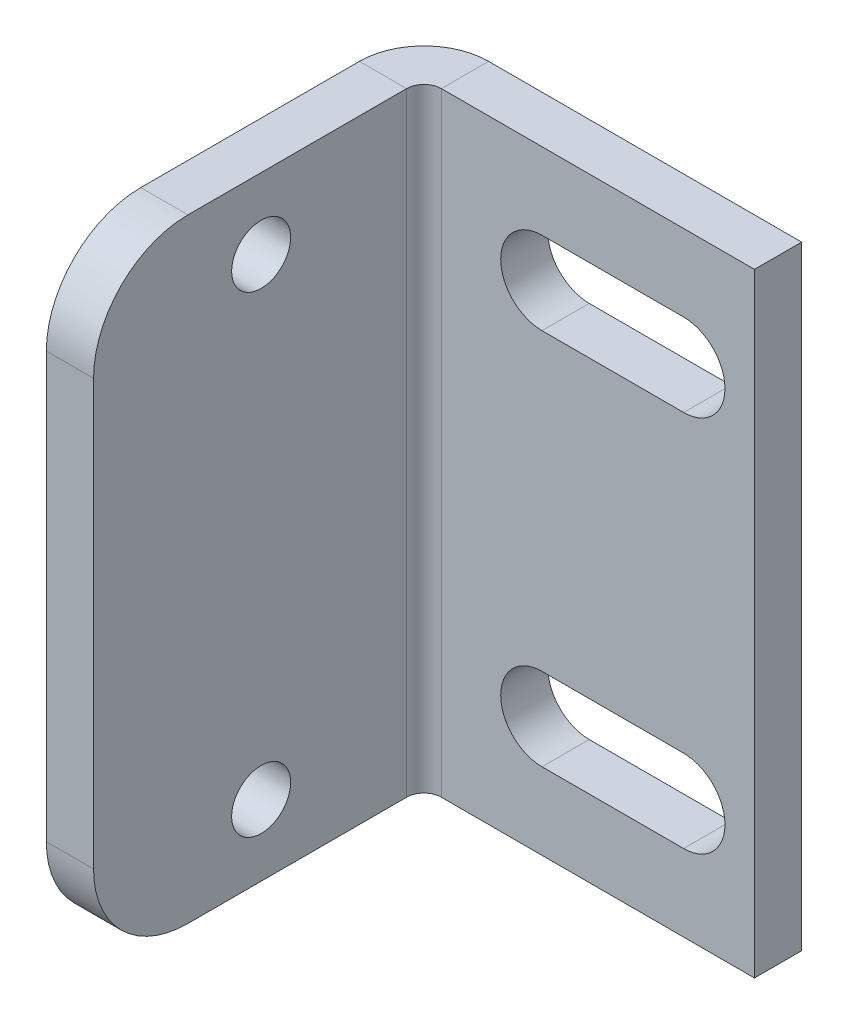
ISO-10303-21;
HEADER;
FILE_DESCRIPTION(('STEP AP214'),'2;1');
FILE_NAME('part.step','',(''),(''),'','','');
FILE_SCHEMA(('AUTOMOTIVE_DESIGN { 1 0 10303 214 1 1 1 1 }'));
ENDSEC;
DATA;
#1=APPLICATION_CONTEXT('core data for automotive mechanical design processes');
#2=APPLICATION_PROTOCOL_DEFINITION('international standard','automotive_design',2000,#1);
#3=PRODUCT_CONTEXT('',#1,'mechanical');
#4=PRODUCT('Part','Part','',(#3));
#5=PRODUCT_RELATED_PRODUCT_CATEGORY('part','',(#4));
#6=PRODUCT_DEFINITION_FORMATION('','',#4);
#7=PRODUCT_DEFINITION_CONTEXT('part definition',#1,'design');
#8=PRODUCT_DEFINITION('design','',#6,#7);
#9=PRODUCT_DEFINITION_SHAPE('','',#8);
#10=(LENGTH_UNIT() NAMED_UNIT(*) SI_UNIT(.MILLI.,.METRE.));
#11=(NAMED_UNIT(*) PLANE_ANGLE_UNIT() SI_UNIT($,.RADIAN.));
#12=(NAMED_UNIT(*) SI_UNIT($,.STERADIAN.) SOLID_ANGLE_UNIT());
#13=UNCERTAINTY_MEASURE_WITH_UNIT(LENGTH_MEASURE(1.E-05),#10,'distance_accuracy_value','');
#14=(GEOMETRIC_REPRESENTATION_CONTEXT(3) GLOBAL_UNCERTAINTY_ASSIGNED_CONTEXT((#13)) GLOBAL_UNIT_ASSIGNED_CONTEXT((#10,
#11,#12)) REPRESENTATION_CONTEXT('',''));
#15=CARTESIAN_POINT('',(0.,0.,0.));
#16=DIRECTION('',(0.,0.,1.));
#17=DIRECTION('',(1.,0.,0.));
#18=AXIS2_PLACEMENT_3D('',#15,#16,#17);
#19=CARTESIAN_POINT('',(0.,-4.47571826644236,2.));
#20=DIRECTION('',(0.,-1.,0.));
#21=DIRECTION('',(1.,0.,0.));
#22=AXIS2_PLACEMENT_3D('',#19,#20,#21);
#23=PLANE('',#22);
#24=DIRECTION('',(0.,0.,-1.));
#25=VECTOR('',#24,1.);
#26=CARTESIAN_POINT('',(-13.2634,-4.47571826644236,2.));
#27=LINE('',#26,#25);
#28=CARTESIAN_POINT('',(-13.2634,-4.47571826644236,2.));
#29=VERTEX_POINT('',#28);
#30=CARTESIAN_POINT('',(-13.2634,-4.47571826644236,0.));
#31=VERTEX_POINT('',#30);
#32=EDGE_CURVE('E262',#29,#31,#27,.T.);
#33=ORIENTED_EDGE('',*,*,#32,.F.);
#34=DIRECTION('',(-1.,0.,0.));
#35=VECTOR('',#34,1.);
#36=CARTESIAN_POINT('',(0.,-4.47571826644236,2.));
#37=LINE('',#36,#35);
#38=CARTESIAN_POINT('',(0.,-4.47571826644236,2.));
#39=VERTEX_POINT('',#38);
#40=EDGE_CURVE('E271',#39,#29,#37,.T.);
#41=ORIENTED_EDGE('',*,*,#40,.F.);
#42=DIRECTION('',(0.,0.,-1.));
#43=VECTOR('',#42,1.);
#44=CARTESIAN_POINT('',(0.,-4.47571826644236,2.));
#45=LINE('',#44,#43);
#46=CARTESIAN_POINT('',(0.,-4.47571826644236,0.));
#47=VERTEX_POINT('',#46);
#48=EDGE_CURVE('E286',#39,#47,#45,.T.);
#49=ORIENTED_EDGE('',*,*,#48,.T.);
#50=DIRECTION('',(-1.,0.,0.));
#51=VECTOR('',#50,1.);
#52=CARTESIAN_POINT('',(0.,-4.47571826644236,0.));
#53=LINE('',#52,#51);
#54=EDGE_CURVE('E280',#47,#31,#53,.T.);
#55=ORIENTED_EDGE('',*,*,#54,.T.);
#56=EDGE_LOOP('',(#33,#41,#49,#55));
#57=FACE_BOUND('',#56,.T.);
#58=ADVANCED_FACE('F16',(#57),#23,.F.);
#59=CARTESIAN_POINT('',(0.,-30.4757182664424,2.));
#60=DIRECTION('',(0.,1.,0.));
#61=DIRECTION('',(-1.,0.,0.));
#62=AXIS2_PLACEMENT_3D('',#59,#60,#61);
#63=PLANE('',#62);
#64=DIRECTION('',(0.,0.,-1.));
#65=VECTOR('',#64,1.);
#66=CARTESIAN_POINT('',(-13.2634,-30.4757182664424,2.));
#67=LINE('',#66,#65);
#68=CARTESIAN_POINT('',(-13.2634,-30.4757182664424,2.));
#69=VERTEX_POINT('',#68);
#70=CARTESIAN_POINT('',(-13.2634,-30.4757182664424,0.));
#71=VERTEX_POINT('',#70);
#72=EDGE_CURVE('E252',#69,#71,#67,.T.);
#73=ORIENTED_EDGE('',*,*,#72,.T.);
#74=DIRECTION('',(1.,0.,0.));
#75=VECTOR('',#74,1.);
#76=CARTESIAN_POINT('',(0.,-30.4757182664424,0.));
#77=LINE('',#76,#75);
#78=CARTESIAN_POINT('',(0.,-30.4757182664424,0.));
#79=VERTEX_POINT('',#78);
#80=EDGE_CURVE('E272',#71,#79,#77,.T.);
#81=ORIENTED_EDGE('',*,*,#80,.T.);
#82=DIRECTION('',(0.,0.,-1.));
#83=VECTOR('',#82,1.);
#84=CARTESIAN_POINT('',(0.,-30.4757182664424,2.));
#85=LINE('',#84,#83);
#86=CARTESIAN_POINT('',(0.,-30.4757182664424,2.));
#87=VERTEX_POINT('',#86);
#88=EDGE_CURVE('E277',#87,#79,#85,.T.);
#89=ORIENTED_EDGE('',*,*,#88,.F.);
#90=DIRECTION('',(1.,0.,0.));
#91=VECTOR('',#90,1.);
#92=CARTESIAN_POINT('',(0.,-30.4757182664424,2.));
#93=LINE('',#92,#91);
#94=EDGE_CURVE('E275',#69,#87,#93,.T.);
#95=ORIENTED_EDGE('',*,*,#94,.F.);
#96=EDGE_LOOP('',(#73,#81,#89,#95));
#97=FACE_BOUND('',#96,.T.);
#98=ADVANCED_FACE('F349',(#97),#63,.F.);
#99=CARTESIAN_POINT('',(0.,0.,2.));
#100=DIRECTION('',(0.,0.,-1.));
#101=DIRECTION('',(-1.,0.,0.));
#102=AXIS2_PLACEMENT_3D('',#99,#100,#101);
#103=PLANE('',#102);
#104=DIRECTION('',(-1.,0.,0.));
#105=VECTOR('',#104,1.);
#106=CARTESIAN_POINT('',(-3.,-7.72571826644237,2.));
#107=LINE('',#106,#105);
#108=CARTESIAN_POINT('',(-3.,-7.72571826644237,2.));
#109=VERTEX_POINT('',#108);
#110=CARTESIAN_POINT('',(-9.,-7.72571826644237,2.));
#111=VERTEX_POINT('',#110);
#112=EDGE_CURVE('E180',#109,#111,#107,.T.);
#113=ORIENTED_EDGE('',*,*,#112,.F.);
#114=CARTESIAN_POINT('',(-3.,-9.47571826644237,2.));
#115=DIRECTION('',(0.,0.,1.));
#116=DIRECTION('',(-1.,0.,0.));
#117=AXIS2_PLACEMENT_3D('',#114,#115,#116);
#118=CIRCLE('',#117,1.75);
#119=CARTESIAN_POINT('',(-3.,-11.2257182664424,2.));
#120=VERTEX_POINT('',#119);
#121=EDGE_CURVE('E150',#120,#109,#118,.T.);
#122=ORIENTED_EDGE('',*,*,#121,.F.);
#123=DIRECTION('',(1.,0.,0.));
#124=VECTOR('',#123,1.);
#125=CARTESIAN_POINT('',(-3.,-11.2257182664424,2.));
#126=LINE('',#125,#124);
#127=CARTESIAN_POINT('',(-9.,-11.2257182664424,2.));
#128=VERTEX_POINT('',#127);
#129=EDGE_CURVE('E168',#128,#120,#126,.T.);
#130=ORIENTED_EDGE('',*,*,#129,.F.);
#131=CARTESIAN_POINT('',(-9.,-9.47571826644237,2.));
#132=DIRECTION('',(0.,0.,1.));
#133=DIRECTION('',(-1.,0.,0.));
#134=AXIS2_PLACEMENT_3D('',#131,#132,#133);
#135=CIRCLE('',#134,1.75);
#136=EDGE_CURVE('E171',#111,#128,#135,.T.);
#137=ORIENTED_EDGE('',*,*,#136,.F.);
#138=EDGE_LOOP('',(#113,#122,#130,#137));
#139=FACE_BOUND('',#138,.T.);
#140=DIRECTION('',(-1.,0.,0.));
#141=VECTOR('',#140,1.);
#142=CARTESIAN_POINT('',(-3.,-23.7257182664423,2.));
#143=LINE('',#142,#141);
#144=CARTESIAN_POINT('',(-3.,-23.7257182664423,2.));
#145=VERTEX_POINT('',#144);
#146=CARTESIAN_POINT('',(-9.,-23.7257182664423,2.));
#147=VERTEX_POINT('',#146);
#148=EDGE_CURVE('E205',#145,#147,#143,.T.);
#149=ORIENTED_EDGE('',*,*,#148,.F.);
#150=CARTESIAN_POINT('',(-3.,-25.4757182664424,2.));
#151=DIRECTION('',(0.,0.,1.));
#152=DIRECTION('',(1.,0.,0.));
#153=AXIS2_PLACEMENT_3D('',#150,#151,#152);
#154=CIRCLE('',#153,1.75);
#155=CARTESIAN_POINT('',(-3.,-27.2257182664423,2.));
#156=VERTEX_POINT('',#155);
#157=EDGE_CURVE('E186',#156,#145,#154,.T.);
#158=ORIENTED_EDGE('',*,*,#157,.F.);
#159=DIRECTION('',(1.,0.,0.));
#160=VECTOR('',#159,1.);
#161=CARTESIAN_POINT('',(-3.,-27.2257182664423,2.));
#162=LINE('',#161,#160);
#163=CARTESIAN_POINT('',(-9.,-27.2257182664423,2.));
#164=VERTEX_POINT('',#163);
#165=EDGE_CURVE('E194',#164,#156,#162,.T.);
#166=ORIENTED_EDGE('',*,*,#165,.F.);
#167=CARTESIAN_POINT('',(-9.,-25.4757182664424,2.));
#168=DIRECTION('',(0.,0.,1.));
#169=DIRECTION('',(1.,0.,0.));
#170=AXIS2_PLACEMENT_3D('',#167,#168,#169);
#171=CIRCLE('',#170,1.75);
#172=EDGE_CURVE('E208',#147,#164,#171,.T.);
#173=ORIENTED_EDGE('',*,*,#172,.F.);
#174=EDGE_LOOP('',(#149,#158,#166,#173));
#175=FACE_BOUND('',#174,.T.);
#176=DIRECTION('',(0.,-1.,0.));
#177=VECTOR('',#176,1.);
#178=CARTESIAN_POINT('',(-13.2634,-30.4757182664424,2.));
#179=LINE('',#178,#177);
#180=EDGE_CURVE('E258',#69,#29,#179,.F.);
#181=ORIENTED_EDGE('',*,*,#180,.F.);
#182=ORIENTED_EDGE('',*,*,#94,.T.);
#183=DIRECTION('',(0.,1.,0.));
#184=VECTOR('',#183,1.);
#185=CARTESIAN_POINT('',(0.,-4.47571826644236,2.));
#186=LINE('',#185,#184);
#187=EDGE_CURVE('E268',#87,#39,#186,.T.);
#188=ORIENTED_EDGE('',*,*,#187,.T.);
#189=ORIENTED_EDGE('',*,*,#40,.T.);
#190=EDGE_LOOP('',(#181,#182,#188,#189));
#191=FACE_BOUND('',#190,.T.);
#192=ADVANCED_FACE('F354',(#139,#175,#191),#103,.F.);
#193=CARTESIAN_POINT('',(0.,0.,0.));
#194=DIRECTION('',(0.,0.,-1.));
#195=DIRECTION('',(-1.,0.,0.));
#196=AXIS2_PLACEMENT_3D('',#193,#194,#195);
#197=PLANE('',#196);
#198=CARTESIAN_POINT('',(-3.,-9.47571826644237,0.));
#199=DIRECTION('',(0.,0.,1.));
#200=DIRECTION('',(-1.,0.,0.));
#201=AXIS2_PLACEMENT_3D('',#198,#199,#200);
#202=CIRCLE('',#201,1.75);
#203=CARTESIAN_POINT('',(-3.,-11.2257182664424,0.));
#204=VERTEX_POINT('',#203);
#205=CARTESIAN_POINT('',(-3.,-7.72571826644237,0.));
#206=VERTEX_POINT('',#205);
#207=EDGE_CURVE('E147',#204,#206,#202,.T.);
#208=ORIENTED_EDGE('',*,*,#207,.T.);
#209=DIRECTION('',(-1.,0.,0.));
#210=VECTOR('',#209,1.);
#211=CARTESIAN_POINT('',(-3.,-7.72571826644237,0.));
#212=LINE('',#211,#210);
#213=CARTESIAN_POINT('',(-9.,-7.72571826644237,0.));
#214=VERTEX_POINT('',#213);
#215=EDGE_CURVE('E159',#206,#214,#212,.T.);
#216=ORIENTED_EDGE('',*,*,#215,.T.);
#217=CARTESIAN_POINT('',(-9.,-9.47571826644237,0.));
#218=DIRECTION('',(0.,0.,1.));
#219=DIRECTION('',(-1.,0.,0.));
#220=AXIS2_PLACEMENT_3D('',#217,#218,#219);
#221=CIRCLE('',#220,1.75);
#222=CARTESIAN_POINT('',(-9.,-11.2257182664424,0.));
#223=VERTEX_POINT('',#222);
#224=EDGE_CURVE('E163',#214,#223,#221,.T.);
#225=ORIENTED_EDGE('',*,*,#224,.T.);
#226=DIRECTION('',(1.,0.,0.));
#227=VECTOR('',#226,1.);
#228=CARTESIAN_POINT('',(-3.,-11.2257182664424,0.));
#229=LINE('',#228,#227);
#230=EDGE_CURVE('E155',#223,#204,#229,.T.);
#231=ORIENTED_EDGE('',*,*,#230,.T.);
#232=EDGE_LOOP('',(#208,#216,#225,#231));
#233=FACE_BOUND('',#232,.T.);
#234=CARTESIAN_POINT('',(-3.,-25.4757182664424,0.));
#235=DIRECTION('',(0.,0.,1.));
#236=DIRECTION('',(1.,0.,0.));
#237=AXIS2_PLACEMENT_3D('',#234,#235,#236);
#238=CIRCLE('',#237,1.75);
#239=CARTESIAN_POINT('',(-3.,-27.2257182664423,0.));
#240=VERTEX_POINT('',#239);
#241=CARTESIAN_POINT('',(-3.,-23.7257182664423,0.));
#242=VERTEX_POINT('',#241);
#243=EDGE_CURVE('E190',#240,#242,#238,.T.);
#244=ORIENTED_EDGE('',*,*,#243,.T.);
#245=DIRECTION('',(-1.,0.,0.));
#246=VECTOR('',#245,1.);
#247=CARTESIAN_POINT('',(-3.,-23.7257182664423,0.));
#248=LINE('',#247,#246);
#249=CARTESIAN_POINT('',(-9.,-23.7257182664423,0.));
#250=VERTEX_POINT('',#249);
#251=EDGE_CURVE('E193',#242,#250,#248,.T.);
#252=ORIENTED_EDGE('',*,*,#251,.T.);
#253=CARTESIAN_POINT('',(-9.,-25.4757182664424,0.));
#254=DIRECTION('',(0.,0.,1.));
#255=DIRECTION('',(1.,0.,0.));
#256=AXIS2_PLACEMENT_3D('',#253,#254,#255);
#257=CIRCLE('',#256,1.75);
#258=CARTESIAN_POINT('',(-9.,-27.2257182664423,0.));
#259=VERTEX_POINT('',#258);
#260=EDGE_CURVE('E197',#250,#259,#257,.T.);
#261=ORIENTED_EDGE('',*,*,#260,.T.);
#262=DIRECTION('',(1.,0.,0.));
#263=VECTOR('',#262,1.);
#264=CARTESIAN_POINT('',(-3.,-27.2257182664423,0.));
#265=LINE('',#264,#263);
#266=EDGE_CURVE('E200',#259,#240,#265,.T.);
#267=ORIENTED_EDGE('',*,*,#266,.T.);
#268=EDGE_LOOP('',(#244,#252,#261,#267));
#269=FACE_BOUND('',#268,.T.);
#270=ORIENTED_EDGE('',*,*,#80,.F.);
#271=DIRECTION('',(0.,-1.,0.));
#272=VECTOR('',#271,1.);
#273=CARTESIAN_POINT('',(-13.2634,-30.4757182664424,0.));
#274=LINE('',#273,#272);
#275=EDGE_CURVE('E245',#71,#31,#274,.F.);
#276=ORIENTED_EDGE('',*,*,#275,.T.);
#277=ORIENTED_EDGE('',*,*,#54,.F.);
#278=DIRECTION('',(0.,1.,0.));
#279=VECTOR('',#278,1.);
#280=CARTESIAN_POINT('',(0.,-4.47571826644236,0.));
#281=LINE('',#280,#279);
#282=EDGE_CURVE('E265',#79,#47,#281,.T.);
#283=ORIENTED_EDGE('',*,*,#282,.F.);
#284=EDGE_LOOP('',(#270,#276,#277,#283));
#285=FACE_BOUND('',#284,.T.);
#286=ADVANCED_FACE('F165',(#233,#269,#285),#197,.T.);
#287=CARTESIAN_POINT('',(0.,-4.47571826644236,2.));
#288=DIRECTION('',(-1.,0.,0.));
#289=DIRECTION('',(0.,-1.,0.));
#290=AXIS2_PLACEMENT_3D('',#287,#288,#289);
#291=PLANE('',#290);
#292=ORIENTED_EDGE('',*,*,#282,.T.);
#293=ORIENTED_EDGE('',*,*,#48,.F.);
#294=ORIENTED_EDGE('',*,*,#187,.F.);
#295=ORIENTED_EDGE('',*,*,#88,.T.);
#296=EDGE_LOOP('',(#292,#293,#294,#295));
#297=FACE_BOUND('',#296,.T.);
#298=ADVANCED_FACE('F345',(#297),#291,.F.);
#299=CARTESIAN_POINT('',(-13.2634,-4.47571826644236,2.7366));
#300=DIRECTION('',(0.,1.,0.));
#301=DIRECTION('',(0.,0.,1.));
#302=AXIS2_PLACEMENT_3D('',#299,#300,#301);
#303=PLANE('',#302);
#304=DIRECTION('',(1.,0.,0.));
#305=VECTOR('',#304,1.);
#306=CARTESIAN_POINT('',(-16.,-4.47571826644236,2.7366));
#307=LINE('',#306,#305);
#308=CARTESIAN_POINT('',(-14.,-4.47571826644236,2.7366));
#309=VERTEX_POINT('',#308);
#310=CARTESIAN_POINT('',(-16.,-4.47571826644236,2.7366));
#311=VERTEX_POINT('',#310);
#312=EDGE_CURVE('E215',#309,#311,#307,.F.);
#313=ORIENTED_EDGE('',*,*,#312,.F.);
#314=CARTESIAN_POINT('',(-13.2634,-4.47571826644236,2.7366));
#315=DIRECTION('',(0.,-1.,0.));
#316=DIRECTION('',(0.,0.,-1.));
#317=AXIS2_PLACEMENT_3D('',#314,#315,#316);
#318=CIRCLE('',#317,0.7366);
#319=EDGE_CURVE('E255',#29,#309,#318,.F.);
#320=ORIENTED_EDGE('',*,*,#319,.F.);
#321=ORIENTED_EDGE('',*,*,#32,.T.);
#322=CARTESIAN_POINT('',(-13.2634,-4.47571826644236,2.7366));
#323=DIRECTION('',(0.,-1.,0.));
#324=DIRECTION('',(0.,0.,-1.));
#325=AXIS2_PLACEMENT_3D('',#322,#323,#324);
#326=CIRCLE('',#325,2.7366);
#327=EDGE_CURVE('E248',#31,#311,#326,.F.);
#328=ORIENTED_EDGE('',*,*,#327,.T.);
#329=EDGE_LOOP('',(#313,#320,#321,#328));
#330=FACE_BOUND('',#329,.T.);
#331=ADVANCED_FACE('F335',(#330),#303,.T.);
#332=CARTESIAN_POINT('',(-13.2634,-30.4757182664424,2.7366));
#333=DIRECTION('',(0.,1.,0.));
#334=DIRECTION('',(0.,0.,1.));
#335=AXIS2_PLACEMENT_3D('',#332,#333,#334);
#336=PLANE('',#335);
#337=CARTESIAN_POINT('',(-13.2634,-30.4757182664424,2.7366));
#338=DIRECTION('',(0.,-1.,0.));
#339=DIRECTION('',(0.,0.,-1.));
#340=AXIS2_PLACEMENT_3D('',#337,#338,#339);
#341=CIRCLE('',#340,0.7366);
#342=CARTESIAN_POINT('',(-14.,-30.4757182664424,2.7366));
#343=VERTEX_POINT('',#342);
#344=EDGE_CURVE('E224',#343,#69,#341,.T.);
#345=ORIENTED_EDGE('',*,*,#344,.F.);
#346=DIRECTION('',(1.,0.,0.));
#347=VECTOR('',#346,1.);
#348=CARTESIAN_POINT('',(-14.,-30.4757182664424,2.7366));
#349=LINE('',#348,#347);
#350=CARTESIAN_POINT('',(-16.,-30.4757182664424,2.7366));
#351=VERTEX_POINT('',#350);
#352=EDGE_CURVE('E238',#343,#351,#349,.F.);
#353=ORIENTED_EDGE('',*,*,#352,.T.);
#354=CARTESIAN_POINT('',(-13.2634,-30.4757182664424,2.7366));
#355=DIRECTION('',(0.,-1.,0.));
#356=DIRECTION('',(0.,0.,-1.));
#357=AXIS2_PLACEMENT_3D('',#354,#355,#356);
#358=CIRCLE('',#357,2.7366);
#359=EDGE_CURVE('E249',#351,#71,#358,.T.);
#360=ORIENTED_EDGE('',*,*,#359,.T.);
#361=ORIENTED_EDGE('',*,*,#72,.F.);
#362=EDGE_LOOP('',(#345,#353,#360,#361));
#363=FACE_BOUND('',#362,.T.);
#364=ADVANCED_FACE('F331',(#363),#336,.F.);
#365=CARTESIAN_POINT('',(-13.2634,-30.4757182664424,2.7366));
#366=DIRECTION('',(0.,-1.,0.));
#367=DIRECTION('',(-1.,0.,0.));
#368=AXIS2_PLACEMENT_3D('',#365,#366,#367);
#369=CYLINDRICAL_SURFACE('',#368,2.7366);
#370=ORIENTED_EDGE('',*,*,#275,.F.);
#371=ORIENTED_EDGE('',*,*,#359,.F.);
#372=DIRECTION('',(0.,-1.,0.));
#373=VECTOR('',#372,1.);
#374=CARTESIAN_POINT('',(-16.,-4.47571826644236,2.7366));
#375=LINE('',#374,#373);
#376=EDGE_CURVE('E235',#351,#311,#375,.F.);
#377=ORIENTED_EDGE('',*,*,#376,.T.);
#378=ORIENTED_EDGE('',*,*,#327,.F.);
#379=EDGE_LOOP('',(#370,#371,#377,#378));
#380=FACE_BOUND('',#379,.T.);
#381=ADVANCED_FACE('F333',(#380),#369,.T.);
#382=CARTESIAN_POINT('',(-13.2634,-30.4757182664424,2.7366));
#383=DIRECTION('',(0.,-1.,0.));
#384=DIRECTION('',(-1.,0.,0.));
#385=AXIS2_PLACEMENT_3D('',#382,#383,#384);
#386=CYLINDRICAL_SURFACE('',#385,0.7366);
#387=ORIENTED_EDGE('',*,*,#180,.T.);
#388=ORIENTED_EDGE('',*,*,#319,.T.);
#389=DIRECTION('',(0.,-1.,0.));
#390=VECTOR('',#389,1.);
#391=CARTESIAN_POINT('',(-14.,-4.47571826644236,2.7366));
#392=LINE('',#391,#390);
#393=EDGE_CURVE('E241',#309,#343,#392,.T.);
#394=ORIENTED_EDGE('',*,*,#393,.T.);
#395=ORIENTED_EDGE('',*,*,#344,.T.);
#396=EDGE_LOOP('',(#387,#388,#394,#395));
#397=FACE_BOUND('',#396,.T.);
#398=ADVANCED_FACE('F352',(#397),#386,.F.);
#399=CARTESIAN_POINT('',(-16.,-4.47571826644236,2.));
#400=DIRECTION('',(0.,-1.,0.));
#401=DIRECTION('',(1.,0.,0.));
#402=AXIS2_PLACEMENT_3D('',#399,#400,#401);
#403=PLANE('',#402);
#404=DIRECTION('',(0.,0.,-1.));
#405=VECTOR('',#404,1.);
#406=CARTESIAN_POINT('',(-16.,-4.47571826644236,0.));
#407=LINE('',#406,#405);
#408=CARTESIAN_POINT('',(-16.,-4.47571826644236,12.));
#409=VERTEX_POINT('',#408);
#410=EDGE_CURVE('E227',#409,#311,#407,.T.);
#411=ORIENTED_EDGE('',*,*,#410,.F.);
#412=DIRECTION('',(1.,0.,0.));
#413=VECTOR('',#412,1.);
#414=CARTESIAN_POINT('',(-16.,-4.47571826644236,12.));
#415=LINE('',#414,#413);
#416=CARTESIAN_POINT('',(-14.,-4.47571826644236,12.));
#417=VERTEX_POINT('',#416);
#418=EDGE_CURVE('E289',#409,#417,#415,.T.);
#419=ORIENTED_EDGE('',*,*,#418,.T.);
#420=DIRECTION('',(0.,0.,1.));
#421=VECTOR('',#420,1.);
#422=CARTESIAN_POINT('',(-14.,-4.47571826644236,2.));
#423=LINE('',#422,#421);
#424=EDGE_CURVE('E233',#417,#309,#423,.F.);
#425=ORIENTED_EDGE('',*,*,#424,.T.);
#426=ORIENTED_EDGE('',*,*,#312,.T.);
#427=EDGE_LOOP('',(#411,#419,#425,#426));
#428=FACE_BOUND('',#427,.T.);
#429=ADVANCED_FACE('F314',(#428),#403,.F.);
#430=CARTESIAN_POINT('',(-16.,-30.4757182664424,16.));
#431=DIRECTION('',(0.,1.,0.));
#432=DIRECTION('',(0.,0.,1.));
#433=AXIS2_PLACEMENT_3D('',#430,#431,#432);
#434=PLANE('',#433);
#435=DIRECTION('',(0.,0.,-1.));
#436=VECTOR('',#435,1.);
#437=CARTESIAN_POINT('',(-14.,-30.4757182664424,16.));
#438=LINE('',#437,#436);
#439=CARTESIAN_POINT('',(-14.,-30.4757182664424,12.));
#440=VERTEX_POINT('',#439);
#441=EDGE_CURVE('E231',#343,#440,#438,.F.);
#442=ORIENTED_EDGE('',*,*,#441,.T.);
#443=DIRECTION('',(1.,0.,0.));
#444=VECTOR('',#443,1.);
#445=CARTESIAN_POINT('',(-16.,-30.4757182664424,12.));
#446=LINE('',#445,#444);
#447=CARTESIAN_POINT('',(-16.,-30.4757182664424,12.));
#448=VERTEX_POINT('',#447);
#449=EDGE_CURVE('E11',#440,#448,#446,.F.);
#450=ORIENTED_EDGE('',*,*,#449,.T.);
#451=DIRECTION('',(0.,0.,1.));
#452=VECTOR('',#451,1.);
#453=CARTESIAN_POINT('',(-16.,-30.4757182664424,0.));
#454=LINE('',#453,#452);
#455=EDGE_CURVE('E225',#351,#448,#454,.T.);
#456=ORIENTED_EDGE('',*,*,#455,.F.);
#457=ORIENTED_EDGE('',*,*,#352,.F.);
#458=EDGE_LOOP('',(#442,#450,#456,#457));
#459=FACE_BOUND('',#458,.T.);
#460=ADVANCED_FACE('F328',(#459),#434,.F.);
#461=CARTESIAN_POINT('',(-16.,0.,0.));
#462=DIRECTION('',(1.,0.,0.));
#463=DIRECTION('',(0.,0.,-1.));
#464=AXIS2_PLACEMENT_3D('',#461,#462,#463);
#465=PLANE('',#464);
#466=CARTESIAN_POINT('',(-16.,-7.47571826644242,8.9));
#467=DIRECTION('',(-1.,0.,0.));
#468=DIRECTION('',(0.,0.,1.));
#469=AXIS2_PLACEMENT_3D('',#466,#467,#468);
#470=CIRCLE('',#469,1.24999999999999);
#471=CARTESIAN_POINT('',(-16.,-7.47571826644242,10.15));
#472=VERTEX_POINT('',#471);
#473=EDGE_CURVE('E294',#472,#472,#470,.T.);
#474=ORIENTED_EDGE('',*,*,#473,.F.);
#475=EDGE_LOOP('',(#474));
#476=FACE_BOUND('',#475,.T.);
#477=CARTESIAN_POINT('',(-16.,-27.4757182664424,8.9));
#478=DIRECTION('',(-1.,0.,0.));
#479=DIRECTION('',(0.,0.,1.));
#480=AXIS2_PLACEMENT_3D('',#477,#478,#479);
#481=CIRCLE('',#480,1.24999999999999);
#482=CARTESIAN_POINT('',(-16.,-27.4757182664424,10.15));
#483=VERTEX_POINT('',#482);
#484=EDGE_CURVE('E293',#483,#483,#481,.T.);
#485=ORIENTED_EDGE('',*,*,#484,.F.);
#486=EDGE_LOOP('',(#485));
#487=FACE_BOUND('',#486,.T.);
#488=DIRECTION('',(0.,1.,0.));
#489=VECTOR('',#488,1.);
#490=CARTESIAN_POINT('',(-16.,0.,16.));
#491=LINE('',#490,#489);
#492=CARTESIAN_POINT('',(-16.,-26.4757182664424,16.));
#493=VERTEX_POINT('',#492);
#494=CARTESIAN_POINT('',(-16.,-8.47571826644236,16.));
#495=VERTEX_POINT('',#494);
#496=EDGE_CURVE('E222',#493,#495,#491,.T.);
#497=ORIENTED_EDGE('',*,*,#496,.T.);
#498=CARTESIAN_POINT('',(-16.,-8.47571826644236,12.));
#499=DIRECTION('',(1.,0.,0.));
#500=DIRECTION('',(0.,0.,-1.));
#501=AXIS2_PLACEMENT_3D('',#498,#499,#500);
#502=CIRCLE('',#501,4.);
#503=EDGE_CURVE('E24',#495,#409,#502,.F.);
#504=ORIENTED_EDGE('',*,*,#503,.T.);
#505=ORIENTED_EDGE('',*,*,#410,.T.);
#506=ORIENTED_EDGE('',*,*,#376,.F.);
#507=ORIENTED_EDGE('',*,*,#455,.T.);
#508=CARTESIAN_POINT('',(-16.,-26.4757182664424,12.));
#509=DIRECTION('',(1.,0.,0.));
#510=DIRECTION('',(0.,0.,-1.));
#511=AXIS2_PLACEMENT_3D('',#508,#509,#510);
#512=CIRCLE('',#511,4.);
#513=EDGE_CURVE('E305',#448,#493,#512,.F.);
#514=ORIENTED_EDGE('',*,*,#513,.T.);
#515=EDGE_LOOP('',(#497,#504,#505,#506,#507,#514));
#516=FACE_BOUND('',#515,.T.);
#517=ADVANCED_FACE('F309',(#476,#487,#516),#465,.F.);
#518=CARTESIAN_POINT('',(-14.,0.,0.));
#519=DIRECTION('',(1.,0.,0.));
#520=DIRECTION('',(0.,0.,-1.));
#521=AXIS2_PLACEMENT_3D('',#518,#519,#520);
#522=PLANE('',#521);
#523=CARTESIAN_POINT('',(-14.,-7.47571826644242,8.9));
#524=DIRECTION('',(1.,0.,0.));
#525=DIRECTION('',(0.,0.,-1.));
#526=AXIS2_PLACEMENT_3D('',#523,#524,#525);
#527=CIRCLE('',#526,1.25);
#528=CARTESIAN_POINT('',(-14.,-7.47571826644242,7.65));
#529=VERTEX_POINT('',#528);
#530=EDGE_CURVE('E290',#529,#529,#527,.T.);
#531=ORIENTED_EDGE('',*,*,#530,.F.);
#532=EDGE_LOOP('',(#531));
#533=FACE_BOUND('',#532,.T.);
#534=CARTESIAN_POINT('',(-14.,-27.4757182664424,8.9));
#535=DIRECTION('',(1.,0.,0.));
#536=DIRECTION('',(0.,0.,-1.));
#537=AXIS2_PLACEMENT_3D('',#534,#535,#536);
#538=CIRCLE('',#537,1.25);
#539=CARTESIAN_POINT('',(-14.,-27.4757182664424,7.65));
#540=VERTEX_POINT('',#539);
#541=EDGE_CURVE('E174',#540,#540,#538,.T.);
#542=ORIENTED_EDGE('',*,*,#541,.F.);
#543=EDGE_LOOP('',(#542));
#544=FACE_BOUND('',#543,.T.);
#545=ORIENTED_EDGE('',*,*,#424,.F.);
#546=CARTESIAN_POINT('',(-14.,-8.47571826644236,12.));
#547=DIRECTION('',(1.,0.,0.));
#548=DIRECTION('',(0.,0.,-1.));
#549=AXIS2_PLACEMENT_3D('',#546,#547,#548);
#550=CIRCLE('',#549,4.);
#551=CARTESIAN_POINT('',(-14.,-8.47571826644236,16.));
#552=VERTEX_POINT('',#551);
#553=EDGE_CURVE('E299',#417,#552,#550,.T.);
#554=ORIENTED_EDGE('',*,*,#553,.T.);
#555=DIRECTION('',(0.,-1.,0.));
#556=VECTOR('',#555,1.);
#557=CARTESIAN_POINT('',(-14.,-4.47571826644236,16.));
#558=LINE('',#557,#556);
#559=CARTESIAN_POINT('',(-14.,-26.4757182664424,16.));
#560=VERTEX_POINT('',#559);
#561=EDGE_CURVE('E229',#560,#552,#558,.F.);
#562=ORIENTED_EDGE('',*,*,#561,.F.);
#563=CARTESIAN_POINT('',(-14.,-26.4757182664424,12.));
#564=DIRECTION('',(1.,0.,0.));
#565=DIRECTION('',(0.,0.,-1.));
#566=AXIS2_PLACEMENT_3D('',#563,#564,#565);
#567=CIRCLE('',#566,4.);
#568=EDGE_CURVE('E297',#560,#440,#567,.T.);
#569=ORIENTED_EDGE('',*,*,#568,.T.);
#570=ORIENTED_EDGE('',*,*,#441,.F.);
#571=ORIENTED_EDGE('',*,*,#393,.F.);
#572=EDGE_LOOP('',(#545,#554,#562,#569,#570,#571));
#573=FACE_BOUND('',#572,.T.);
#574=ADVANCED_FACE('F320',(#533,#544,#573),#522,.T.);
#575=CARTESIAN_POINT('',(-16.,-4.47571826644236,16.));
#576=DIRECTION('',(0.,0.,-1.));
#577=DIRECTION('',(-1.,0.,0.));
#578=AXIS2_PLACEMENT_3D('',#575,#576,#577);
#579=PLANE('',#578);
#580=ORIENTED_EDGE('',*,*,#561,.T.);
#581=DIRECTION('',(1.,0.,0.));
#582=VECTOR('',#581,1.);
#583=CARTESIAN_POINT('',(-16.,-8.47571826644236,16.));
#584=LINE('',#583,#582);
#585=EDGE_CURVE('E37',#552,#495,#584,.F.);
#586=ORIENTED_EDGE('',*,*,#585,.T.);
#587=ORIENTED_EDGE('',*,*,#496,.F.);
#588=DIRECTION('',(1.,0.,0.));
#589=VECTOR('',#588,1.);
#590=CARTESIAN_POINT('',(-16.,-26.4757182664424,16.));
#591=LINE('',#590,#589);
#592=EDGE_CURVE('E301',#493,#560,#591,.T.);
#593=ORIENTED_EDGE('',*,*,#592,.T.);
#594=EDGE_LOOP('',(#580,#586,#587,#593));
#595=FACE_BOUND('',#594,.T.);
#596=ADVANCED_FACE('F322',(#595),#579,.F.);
#597=CARTESIAN_POINT('',(-3.,-25.4757182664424,0.));
#598=DIRECTION('',(0.,0.,1.));
#599=DIRECTION('',(1.,0.,0.));
#600=AXIS2_PLACEMENT_3D('',#597,#598,#599);
#601=CYLINDRICAL_SURFACE('',#600,1.75);
#602=ORIENTED_EDGE('',*,*,#157,.T.);
#603=DIRECTION('',(0.,0.,1.));
#604=VECTOR('',#603,1.);
#605=CARTESIAN_POINT('',(-3.,-23.7257182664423,0.));
#606=LINE('',#605,#604);
#607=EDGE_CURVE('E203',#242,#145,#606,.T.);
#608=ORIENTED_EDGE('',*,*,#607,.F.);
#609=ORIENTED_EDGE('',*,*,#243,.F.);
#610=DIRECTION('',(0.,0.,1.));
#611=VECTOR('',#610,1.);
#612=CARTESIAN_POINT('',(-3.,-27.2257182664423,0.));
#613=LINE('',#612,#611);
#614=EDGE_CURVE('E213',#240,#156,#613,.T.);
#615=ORIENTED_EDGE('',*,*,#614,.T.);
#616=EDGE_LOOP('',(#602,#608,#609,#615));
#617=FACE_BOUND('',#616,.T.);
#618=ADVANCED_FACE('F410',(#617),#601,.F.);
#619=CARTESIAN_POINT('',(-3.,-27.2257182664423,0.));
#620=DIRECTION('',(0.,-1.,0.));
#621=DIRECTION('',(1.,0.,0.));
#622=AXIS2_PLACEMENT_3D('',#619,#620,#621);
#623=PLANE('',#622);
#624=ORIENTED_EDGE('',*,*,#165,.T.);
#625=ORIENTED_EDGE('',*,*,#614,.F.);
#626=ORIENTED_EDGE('',*,*,#266,.F.);
#627=DIRECTION('',(0.,0.,1.));
#628=VECTOR('',#627,1.);
#629=CARTESIAN_POINT('',(-9.,-27.2257182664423,0.));
#630=LINE('',#629,#628);
#631=EDGE_CURVE('E216',#259,#164,#630,.T.);
#632=ORIENTED_EDGE('',*,*,#631,.T.);
#633=EDGE_LOOP('',(#624,#625,#626,#632));
#634=FACE_BOUND('',#633,.T.);
#635=ADVANCED_FACE('F406',(#634),#623,.F.);
#636=CARTESIAN_POINT('',(-9.,-25.4757182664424,0.));
#637=DIRECTION('',(0.,0.,1.));
#638=DIRECTION('',(1.,0.,0.));
#639=AXIS2_PLACEMENT_3D('',#636,#637,#638);
#640=CYLINDRICAL_SURFACE('',#639,1.75);
#641=ORIENTED_EDGE('',*,*,#172,.T.);
#642=ORIENTED_EDGE('',*,*,#631,.F.);
#643=ORIENTED_EDGE('',*,*,#260,.F.);
#644=DIRECTION('',(0.,0.,1.));
#645=VECTOR('',#644,1.);
#646=CARTESIAN_POINT('',(-9.,-23.7257182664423,0.));
#647=LINE('',#646,#645);
#648=EDGE_CURVE('E218',#250,#147,#647,.T.);
#649=ORIENTED_EDGE('',*,*,#648,.T.);
#650=EDGE_LOOP('',(#641,#642,#643,#649));
#651=FACE_BOUND('',#650,.T.);
#652=ADVANCED_FACE('F409',(#651),#640,.F.);
#653=CARTESIAN_POINT('',(-3.,-23.7257182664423,0.));
#654=DIRECTION('',(0.,1.,0.));
#655=DIRECTION('',(-1.,0.,0.));
#656=AXIS2_PLACEMENT_3D('',#653,#654,#655);
#657=PLANE('',#656);
#658=ORIENTED_EDGE('',*,*,#148,.T.);
#659=ORIENTED_EDGE('',*,*,#648,.F.);
#660=ORIENTED_EDGE('',*,*,#251,.F.);
#661=ORIENTED_EDGE('',*,*,#607,.T.);
#662=EDGE_LOOP('',(#658,#659,#660,#661));
#663=FACE_BOUND('',#662,.T.);
#664=ADVANCED_FACE('F405',(#663),#657,.F.);
#665=CARTESIAN_POINT('',(-3.,-9.47571826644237,0.));
#666=DIRECTION('',(0.,0.,1.));
#667=DIRECTION('',(1.,0.,0.));
#668=AXIS2_PLACEMENT_3D('',#665,#666,#667);
#669=CYLINDRICAL_SURFACE('',#668,1.75);
#670=ORIENTED_EDGE('',*,*,#121,.T.);
#671=DIRECTION('',(0.,0.,1.));
#672=VECTOR('',#671,1.);
#673=CARTESIAN_POINT('',(-3.,-7.72571826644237,0.));
#674=LINE('',#673,#672);
#675=EDGE_CURVE('E143',#206,#109,#674,.T.);
#676=ORIENTED_EDGE('',*,*,#675,.F.);
#677=ORIENTED_EDGE('',*,*,#207,.F.);
#678=DIRECTION('',(0.,0.,1.));
#679=VECTOR('',#678,1.);
#680=CARTESIAN_POINT('',(-3.,-11.2257182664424,0.));
#681=LINE('',#680,#679);
#682=EDGE_CURVE('E184',#204,#120,#681,.T.);
#683=ORIENTED_EDGE('',*,*,#682,.T.);
#684=EDGE_LOOP('',(#670,#676,#677,#683));
#685=FACE_BOUND('',#684,.T.);
#686=ADVANCED_FACE('F145',(#685),#669,.F.);
#687=CARTESIAN_POINT('',(-3.,-11.2257182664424,0.));
#688=DIRECTION('',(0.,-1.,0.));
#689=DIRECTION('',(1.,0.,0.));
#690=AXIS2_PLACEMENT_3D('',#687,#688,#689);
#691=PLANE('',#690);
#692=ORIENTED_EDGE('',*,*,#129,.T.);
#693=ORIENTED_EDGE('',*,*,#682,.F.);
#694=ORIENTED_EDGE('',*,*,#230,.F.);
#695=DIRECTION('',(0.,0.,1.));
#696=VECTOR('',#695,1.);
#697=CARTESIAN_POINT('',(-9.,-11.2257182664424,0.));
#698=LINE('',#697,#696);
#699=EDGE_CURVE('E187',#223,#128,#698,.T.);
#700=ORIENTED_EDGE('',*,*,#699,.T.);
#701=EDGE_LOOP('',(#692,#693,#694,#700));
#702=FACE_BOUND('',#701,.T.);
#703=ADVANCED_FACE('F393',(#702),#691,.F.);
#704=CARTESIAN_POINT('',(-9.,-9.47571826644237,0.));
#705=DIRECTION('',(0.,0.,1.));
#706=DIRECTION('',(1.,0.,0.));
#707=AXIS2_PLACEMENT_3D('',#704,#705,#706);
#708=CYLINDRICAL_SURFACE('',#707,1.75);
#709=ORIENTED_EDGE('',*,*,#136,.T.);
#710=ORIENTED_EDGE('',*,*,#699,.F.);
#711=ORIENTED_EDGE('',*,*,#224,.F.);
#712=DIRECTION('',(0.,0.,1.));
#713=VECTOR('',#712,1.);
#714=CARTESIAN_POINT('',(-9.,-7.72571826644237,0.));
#715=LINE('',#714,#713);
#716=EDGE_CURVE('E154',#214,#111,#715,.T.);
#717=ORIENTED_EDGE('',*,*,#716,.T.);
#718=EDGE_LOOP('',(#709,#710,#711,#717));
#719=FACE_BOUND('',#718,.T.);
#720=ADVANCED_FACE('F396',(#719),#708,.F.);
#721=CARTESIAN_POINT('',(-3.,-7.72571826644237,0.));
#722=DIRECTION('',(0.,1.,0.));
#723=DIRECTION('',(-1.,0.,0.));
#724=AXIS2_PLACEMENT_3D('',#721,#722,#723);
#725=PLANE('',#724);
#726=ORIENTED_EDGE('',*,*,#112,.T.);
#727=ORIENTED_EDGE('',*,*,#716,.F.);
#728=ORIENTED_EDGE('',*,*,#215,.F.);
#729=ORIENTED_EDGE('',*,*,#675,.T.);
#730=EDGE_LOOP('',(#726,#727,#728,#729));
#731=FACE_BOUND('',#730,.T.);
#732=ADVANCED_FACE('F160',(#731),#725,.F.);
#733=CARTESIAN_POINT('',(-16.,-27.4757182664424,8.9));
#734=DIRECTION('',(-1.,0.,0.));
#735=DIRECTION('',(0.,0.,1.));
#736=AXIS2_PLACEMENT_3D('',#733,#734,#735);
#737=CYLINDRICAL_SURFACE('',#736,1.25);
#738=ORIENTED_EDGE('',*,*,#541,.T.);
#739=EDGE_LOOP('',(#738));
#740=FACE_BOUND('',#739,.T.);
#741=ORIENTED_EDGE('',*,*,#484,.T.);
#742=EDGE_LOOP('',(#741));
#743=FACE_BOUND('',#742,.T.);
#744=ADVANCED_FACE('F382',(#740,#743),#737,.F.);
#745=CARTESIAN_POINT('',(-16.,-7.47571826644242,8.9));
#746=DIRECTION('',(-1.,0.,0.));
#747=DIRECTION('',(0.,0.,1.));
#748=AXIS2_PLACEMENT_3D('',#745,#746,#747);
#749=CYLINDRICAL_SURFACE('',#748,1.25);
#750=ORIENTED_EDGE('',*,*,#530,.T.);
#751=EDGE_LOOP('',(#750));
#752=FACE_BOUND('',#751,.T.);
#753=ORIENTED_EDGE('',*,*,#473,.T.);
#754=EDGE_LOOP('',(#753));
#755=FACE_BOUND('',#754,.T.);
#756=ADVANCED_FACE('F376',(#752,#755),#749,.F.);
#757=CARTESIAN_POINT('',(-16.,-8.47571826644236,12.));
#758=DIRECTION('',(1.,0.,0.));
#759=DIRECTION('',(0.,0.,-1.));
#760=AXIS2_PLACEMENT_3D('',#757,#758,#759);
#761=CYLINDRICAL_SURFACE('',#760,4.);
#762=ORIENTED_EDGE('',*,*,#503,.F.);
#763=ORIENTED_EDGE('',*,*,#585,.F.);
#764=ORIENTED_EDGE('',*,*,#553,.F.);
#765=ORIENTED_EDGE('',*,*,#418,.F.);
#766=EDGE_LOOP('',(#762,#763,#764,#765));
#767=FACE_BOUND('',#766,.T.);
#768=ADVANCED_FACE('F317',(#767),#761,.T.);
#769=CARTESIAN_POINT('',(-16.,-26.4757182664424,12.));
#770=DIRECTION('',(1.,0.,0.));
#771=DIRECTION('',(0.,0.,-1.));
#772=AXIS2_PLACEMENT_3D('',#769,#770,#771);
#773=CYLINDRICAL_SURFACE('',#772,4.);
#774=ORIENTED_EDGE('',*,*,#513,.F.);
#775=ORIENTED_EDGE('',*,*,#449,.F.);
#776=ORIENTED_EDGE('',*,*,#568,.F.);
#777=ORIENTED_EDGE('',*,*,#592,.F.);
#778=EDGE_LOOP('',(#774,#775,#776,#777));
#779=FACE_BOUND('',#778,.T.);
#780=ADVANCED_FACE('F18',(#779),#773,.T.);
#781=CLOSED_SHELL('',(#58,#98,#192,#286,#298,#331,#364,#381,#398,#429,#460,#517,#574,#596,#618,
#635,#652,#664,#686,#703,#720,#732,#744,#756,#768,#780));
#782=MANIFOLD_SOLID_BREP('B1',#781);
#783=ADVANCED_BREP_SHAPE_REPRESENTATION('',(#18,#782),#14);
#784=SHAPE_DEFINITION_REPRESENTATION(#9,#783);
ENDSEC;
END-ISO-10303-21;
